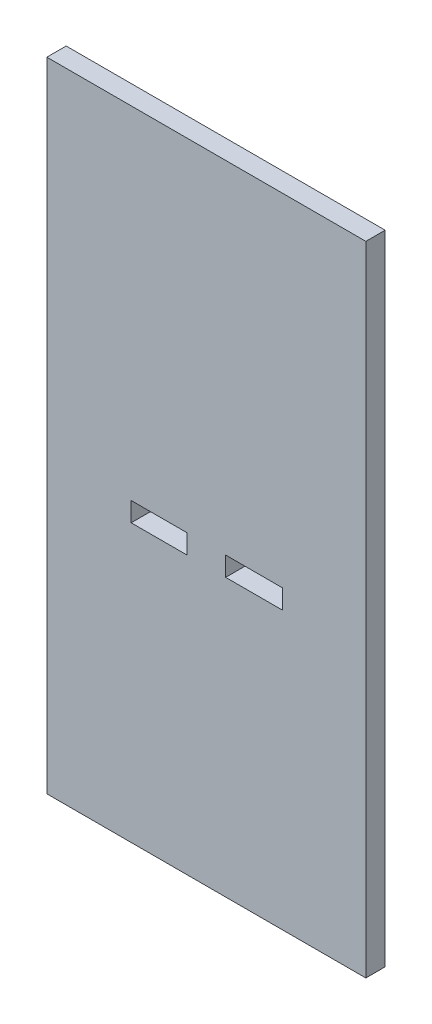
ISO-10303-21;
HEADER;
FILE_DESCRIPTION(('STEP AP214'),'2;1');
FILE_NAME('part.step','',(''),(''),'','','');
FILE_SCHEMA(('AUTOMOTIVE_DESIGN { 1 0 10303 214 1 1 1 1 }'));
ENDSEC;
DATA;
#1=APPLICATION_CONTEXT('core data for automotive mechanical design processes');
#2=APPLICATION_PROTOCOL_DEFINITION('international standard','automotive_design',2000,#1);
#3=PRODUCT_CONTEXT('',#1,'mechanical');
#4=PRODUCT('Part','Part','',(#3));
#5=PRODUCT_RELATED_PRODUCT_CATEGORY('part','',(#4));
#6=PRODUCT_DEFINITION_FORMATION('','',#4);
#7=PRODUCT_DEFINITION_CONTEXT('part definition',#1,'design');
#8=PRODUCT_DEFINITION('design','',#6,#7);
#9=PRODUCT_DEFINITION_SHAPE('','',#8);
#10=(LENGTH_UNIT() NAMED_UNIT(*) SI_UNIT(.MILLI.,.METRE.));
#11=(NAMED_UNIT(*) PLANE_ANGLE_UNIT() SI_UNIT($,.RADIAN.));
#12=(NAMED_UNIT(*) SI_UNIT($,.STERADIAN.) SOLID_ANGLE_UNIT());
#13=UNCERTAINTY_MEASURE_WITH_UNIT(LENGTH_MEASURE(1.E-05),#10,'distance_accuracy_value','');
#14=(GEOMETRIC_REPRESENTATION_CONTEXT(3) GLOBAL_UNCERTAINTY_ASSIGNED_CONTEXT((#13)) GLOBAL_UNIT_ASSIGNED_CONTEXT((#10,
#11,#12)) REPRESENTATION_CONTEXT('',''));
#15=CARTESIAN_POINT('',(0.,0.,0.));
#16=DIRECTION('',(0.,0.,1.));
#17=DIRECTION('',(1.,0.,0.));
#18=AXIS2_PLACEMENT_3D('',#15,#16,#17);
#19=CARTESIAN_POINT('',(488.098625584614,0.,5.3848));
#20=DIRECTION('',(1.,0.,0.));
#21=DIRECTION('',(0.,0.,-1.));
#22=AXIS2_PLACEMENT_3D('',#19,#20,#21);
#23=PLANE('',#22);
#24=DIRECTION('',(0.,-1.,0.));
#25=VECTOR('',#24,1.);
#26=CARTESIAN_POINT('',(488.098625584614,0.,0.));
#27=LINE('',#26,#25);
#28=CARTESIAN_POINT('',(488.098625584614,502.023328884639,0.));
#29=VERTEX_POINT('',#28);
#30=CARTESIAN_POINT('',(488.098625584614,496.638528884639,0.));
#31=VERTEX_POINT('',#30);
#32=EDGE_CURVE('E175',#29,#31,#27,.T.);
#33=ORIENTED_EDGE('',*,*,#32,.T.);
#34=DIRECTION('',(0.,0.,-1.));
#35=VECTOR('',#34,1.);
#36=CARTESIAN_POINT('',(488.098625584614,496.638528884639,5.3848));
#37=LINE('',#36,#35);
#38=CARTESIAN_POINT('',(488.098625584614,496.638528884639,5.3848));
#39=VERTEX_POINT('',#38);
#40=EDGE_CURVE('E11',#39,#31,#37,.T.);
#41=ORIENTED_EDGE('',*,*,#40,.F.);
#42=DIRECTION('',(0.,-1.,0.));
#43=VECTOR('',#42,1.);
#44=CARTESIAN_POINT('',(488.098625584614,0.,5.3848));
#45=LINE('',#44,#43);
#46=CARTESIAN_POINT('',(488.098625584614,502.023328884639,5.3848));
#47=VERTEX_POINT('',#46);
#48=EDGE_CURVE('E137',#47,#39,#45,.T.);
#49=ORIENTED_EDGE('',*,*,#48,.F.);
#50=DIRECTION('',(0.,0.,-1.));
#51=VECTOR('',#50,1.);
#52=CARTESIAN_POINT('',(488.098625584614,502.023328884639,5.3848));
#53=LINE('',#52,#51);
#54=EDGE_CURVE('E182',#47,#29,#53,.T.);
#55=ORIENTED_EDGE('',*,*,#54,.T.);
#56=EDGE_LOOP('',(#33,#41,#49,#55));
#57=FACE_BOUND('',#56,.T.);
#58=ADVANCED_FACE('F32',(#57),#23,.F.);
#59=CARTESIAN_POINT('',(0.,496.638528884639,5.3848));
#60=DIRECTION('',(0.,-1.,0.));
#61=DIRECTION('',(0.,0.,-1.));
#62=AXIS2_PLACEMENT_3D('',#59,#60,#61);
#63=PLANE('',#62);
#64=DIRECTION('',(-1.,0.,0.));
#65=VECTOR('',#64,1.);
#66=CARTESIAN_POINT('',(0.,496.638528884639,0.));
#67=LINE('',#66,#65);
#68=CARTESIAN_POINT('',(472.528425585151,496.638528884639,0.));
#69=VERTEX_POINT('',#68);
#70=EDGE_CURVE('E142',#31,#69,#67,.T.);
#71=ORIENTED_EDGE('',*,*,#70,.T.);
#72=DIRECTION('',(0.,0.,-1.));
#73=VECTOR('',#72,1.);
#74=CARTESIAN_POINT('',(472.528425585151,496.638528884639,5.3848));
#75=LINE('',#74,#73);
#76=CARTESIAN_POINT('',(472.528425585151,496.638528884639,5.3848));
#77=VERTEX_POINT('',#76);
#78=EDGE_CURVE('E42',#77,#69,#75,.T.);
#79=ORIENTED_EDGE('',*,*,#78,.F.);
#80=DIRECTION('',(-1.,0.,0.));
#81=VECTOR('',#80,1.);
#82=CARTESIAN_POINT('',(0.,496.638528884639,5.3848));
#83=LINE('',#82,#81);
#84=EDGE_CURVE('E131',#39,#77,#83,.T.);
#85=ORIENTED_EDGE('',*,*,#84,.F.);
#86=ORIENTED_EDGE('',*,*,#40,.T.);
#87=EDGE_LOOP('',(#71,#79,#85,#86));
#88=FACE_BOUND('',#87,.T.);
#89=ADVANCED_FACE('F141',(#88),#63,.F.);
#90=CARTESIAN_POINT('',(472.528425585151,0.,5.3848));
#91=DIRECTION('',(-1.,0.,0.));
#92=DIRECTION('',(0.,0.,1.));
#93=AXIS2_PLACEMENT_3D('',#90,#91,#92);
#94=PLANE('',#93);
#95=DIRECTION('',(0.,1.,0.));
#96=VECTOR('',#95,1.);
#97=CARTESIAN_POINT('',(472.528425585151,0.,0.));
#98=LINE('',#97,#96);
#99=CARTESIAN_POINT('',(472.528425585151,502.023328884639,0.));
#100=VERTEX_POINT('',#99);
#101=EDGE_CURVE('E92',#69,#100,#98,.T.);
#102=ORIENTED_EDGE('',*,*,#101,.T.);
#103=DIRECTION('',(0.,0.,-1.));
#104=VECTOR('',#103,1.);
#105=CARTESIAN_POINT('',(472.528425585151,502.023328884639,5.3848));
#106=LINE('',#105,#104);
#107=CARTESIAN_POINT('',(472.528425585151,502.023328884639,5.3848));
#108=VERTEX_POINT('',#107);
#109=EDGE_CURVE('E143',#108,#100,#106,.T.);
#110=ORIENTED_EDGE('',*,*,#109,.F.);
#111=DIRECTION('',(0.,1.,0.));
#112=VECTOR('',#111,1.);
#113=CARTESIAN_POINT('',(472.528425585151,0.,5.3848));
#114=LINE('',#113,#112);
#115=EDGE_CURVE('E135',#77,#108,#114,.T.);
#116=ORIENTED_EDGE('',*,*,#115,.F.);
#117=ORIENTED_EDGE('',*,*,#78,.T.);
#118=EDGE_LOOP('',(#102,#110,#116,#117));
#119=FACE_BOUND('',#118,.T.);
#120=ADVANCED_FACE('F145',(#119),#94,.F.);
#121=CARTESIAN_POINT('',(537.933425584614,0.,5.3848));
#122=DIRECTION('',(1.,0.,0.));
#123=DIRECTION('',(0.,0.,-1.));
#124=AXIS2_PLACEMENT_3D('',#121,#122,#123);
#125=PLANE('',#124);
#126=DIRECTION('',(0.,-1.,0.));
#127=VECTOR('',#126,1.);
#128=CARTESIAN_POINT('',(537.933425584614,0.,0.));
#129=LINE('',#128,#127);
#130=CARTESIAN_POINT('',(537.933425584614,597.273328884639,0.));
#131=VERTEX_POINT('',#130);
#132=CARTESIAN_POINT('',(537.933425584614,419.473328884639,0.));
#133=VERTEX_POINT('',#132);
#134=EDGE_CURVE('E163',#131,#133,#129,.T.);
#135=ORIENTED_EDGE('',*,*,#134,.F.);
#136=DIRECTION('',(0.,0.,-1.));
#137=VECTOR('',#136,1.);
#138=CARTESIAN_POINT('',(537.933425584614,597.273328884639,5.3848));
#139=LINE('',#138,#137);
#140=CARTESIAN_POINT('',(537.933425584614,597.273328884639,5.3848));
#141=VERTEX_POINT('',#140);
#142=EDGE_CURVE('E184',#141,#131,#139,.T.);
#143=ORIENTED_EDGE('',*,*,#142,.F.);
#144=DIRECTION('',(0.,-1.,0.));
#145=VECTOR('',#144,1.);
#146=CARTESIAN_POINT('',(537.933425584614,0.,5.3848));
#147=LINE('',#146,#145);
#148=CARTESIAN_POINT('',(537.933425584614,419.473328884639,5.3848));
#149=VERTEX_POINT('',#148);
#150=EDGE_CURVE('E221',#141,#149,#147,.T.);
#151=ORIENTED_EDGE('',*,*,#150,.T.);
#152=DIRECTION('',(0.,0.,-1.));
#153=VECTOR('',#152,1.);
#154=CARTESIAN_POINT('',(537.933425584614,419.473328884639,5.3848));
#155=LINE('',#154,#153);
#156=EDGE_CURVE('E186',#149,#133,#155,.T.);
#157=ORIENTED_EDGE('',*,*,#156,.T.);
#158=EDGE_LOOP('',(#135,#143,#151,#157));
#159=FACE_BOUND('',#158,.T.);
#160=ADVANCED_FACE('F243',(#159),#125,.T.);
#161=CARTESIAN_POINT('',(0.,597.273328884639,5.3848));
#162=DIRECTION('',(0.,1.,0.));
#163=DIRECTION('',(0.,0.,1.));
#164=AXIS2_PLACEMENT_3D('',#161,#162,#163);
#165=PLANE('',#164);
#166=DIRECTION('',(1.,0.,0.));
#167=VECTOR('',#166,1.);
#168=CARTESIAN_POINT('',(0.,597.273328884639,0.));
#169=LINE('',#168,#167);
#170=CARTESIAN_POINT('',(449.033425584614,597.273328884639,0.));
#171=VERTEX_POINT('',#170);
#172=EDGE_CURVE('E166',#171,#131,#169,.T.);
#173=ORIENTED_EDGE('',*,*,#172,.F.);
#174=DIRECTION('',(0.,0.,-1.));
#175=VECTOR('',#174,1.);
#176=CARTESIAN_POINT('',(449.033425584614,597.273328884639,5.3848));
#177=LINE('',#176,#175);
#178=CARTESIAN_POINT('',(449.033425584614,597.273328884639,5.3848));
#179=VERTEX_POINT('',#178);
#180=EDGE_CURVE('E191',#179,#171,#177,.T.);
#181=ORIENTED_EDGE('',*,*,#180,.F.);
#182=DIRECTION('',(1.,0.,0.));
#183=VECTOR('',#182,1.);
#184=CARTESIAN_POINT('',(0.,597.273328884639,5.3848));
#185=LINE('',#184,#183);
#186=EDGE_CURVE('E224',#179,#141,#185,.T.);
#187=ORIENTED_EDGE('',*,*,#186,.T.);
#188=ORIENTED_EDGE('',*,*,#142,.T.);
#189=EDGE_LOOP('',(#173,#181,#187,#188));
#190=FACE_BOUND('',#189,.T.);
#191=ADVANCED_FACE('F246',(#190),#165,.T.);
#192=CARTESIAN_POINT('',(449.033425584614,-1.38777878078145E-13,5.3848));
#193=DIRECTION('',(1.,0.,0.));
#194=DIRECTION('',(0.,1.,0.));
#195=AXIS2_PLACEMENT_3D('',#192,#193,#194);
#196=PLANE('',#195);
#197=DIRECTION('',(0.,-1.,0.));
#198=VECTOR('',#197,1.);
#199=CARTESIAN_POINT('',(449.033425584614,-1.38777878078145E-13,0.));
#200=LINE('',#199,#198);
#201=CARTESIAN_POINT('',(449.033425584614,419.473328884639,0.));
#202=VERTEX_POINT('',#201);
#203=EDGE_CURVE('E169',#171,#202,#200,.T.);
#204=ORIENTED_EDGE('',*,*,#203,.T.);
#205=DIRECTION('',(0.,0.,-1.));
#206=VECTOR('',#205,1.);
#207=CARTESIAN_POINT('',(449.033425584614,419.473328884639,5.3848));
#208=LINE('',#207,#206);
#209=CARTESIAN_POINT('',(449.033425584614,419.473328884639,5.3848));
#210=VERTEX_POINT('',#209);
#211=EDGE_CURVE('E188',#210,#202,#208,.T.);
#212=ORIENTED_EDGE('',*,*,#211,.F.);
#213=DIRECTION('',(0.,-1.,0.));
#214=VECTOR('',#213,1.);
#215=CARTESIAN_POINT('',(449.033425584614,-1.38777878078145E-13,5.3848));
#216=LINE('',#215,#214);
#217=EDGE_CURVE('E230',#179,#210,#216,.T.);
#218=ORIENTED_EDGE('',*,*,#217,.F.);
#219=ORIENTED_EDGE('',*,*,#180,.T.);
#220=EDGE_LOOP('',(#204,#212,#218,#219));
#221=FACE_BOUND('',#220,.T.);
#222=ADVANCED_FACE('F249',(#221),#196,.F.);
#223=CARTESIAN_POINT('',(0.,496.638528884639,5.3848));
#224=DIRECTION('',(0.,1.,0.));
#225=DIRECTION('',(0.,0.,1.));
#226=AXIS2_PLACEMENT_3D('',#223,#224,#225);
#227=PLANE('',#226);
#228=DIRECTION('',(1.,0.,0.));
#229=VECTOR('',#228,1.);
#230=CARTESIAN_POINT('',(0.,496.638528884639,0.));
#231=LINE('',#230,#229);
#232=CARTESIAN_POINT('',(498.868225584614,496.638528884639,0.));
#233=VERTEX_POINT('',#232);
#234=CARTESIAN_POINT('',(514.692425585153,496.638528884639,0.));
#235=VERTEX_POINT('',#234);
#236=EDGE_CURVE('E151',#233,#235,#231,.T.);
#237=ORIENTED_EDGE('',*,*,#236,.F.);
#238=DIRECTION('',(0.,0.,-1.));
#239=VECTOR('',#238,1.);
#240=CARTESIAN_POINT('',(498.868225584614,496.638528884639,5.3848));
#241=LINE('',#240,#239);
#242=CARTESIAN_POINT('',(498.868225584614,496.638528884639,5.3848));
#243=VERTEX_POINT('',#242);
#244=EDGE_CURVE('E36',#243,#233,#241,.T.);
#245=ORIENTED_EDGE('',*,*,#244,.F.);
#246=DIRECTION('',(1.,0.,0.));
#247=VECTOR('',#246,1.);
#248=CARTESIAN_POINT('',(0.,496.638528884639,5.3848));
#249=LINE('',#248,#247);
#250=CARTESIAN_POINT('',(514.692425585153,496.638528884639,5.3848));
#251=VERTEX_POINT('',#250);
#252=EDGE_CURVE('E181',#243,#251,#249,.T.);
#253=ORIENTED_EDGE('',*,*,#252,.T.);
#254=DIRECTION('',(0.,0.,-1.));
#255=VECTOR('',#254,1.);
#256=CARTESIAN_POINT('',(514.692425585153,496.638528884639,5.3848));
#257=LINE('',#256,#255);
#258=EDGE_CURVE('E147',#251,#235,#257,.T.);
#259=ORIENTED_EDGE('',*,*,#258,.T.);
#260=EDGE_LOOP('',(#237,#245,#253,#259));
#261=FACE_BOUND('',#260,.T.);
#262=ADVANCED_FACE('F34',(#261),#227,.T.);
#263=CARTESIAN_POINT('',(498.868225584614,0.,5.3848));
#264=DIRECTION('',(1.,0.,0.));
#265=DIRECTION('',(0.,0.,-1.));
#266=AXIS2_PLACEMENT_3D('',#263,#264,#265);
#267=PLANE('',#266);
#268=DIRECTION('',(0.,-1.,0.));
#269=VECTOR('',#268,1.);
#270=CARTESIAN_POINT('',(498.868225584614,0.,0.));
#271=LINE('',#270,#269);
#272=CARTESIAN_POINT('',(498.868225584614,502.023328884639,0.));
#273=VERTEX_POINT('',#272);
#274=EDGE_CURVE('E154',#273,#233,#271,.T.);
#275=ORIENTED_EDGE('',*,*,#274,.F.);
#276=DIRECTION('',(0.,0.,-1.));
#277=VECTOR('',#276,1.);
#278=CARTESIAN_POINT('',(498.868225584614,502.023328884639,5.3848));
#279=LINE('',#278,#277);
#280=CARTESIAN_POINT('',(498.868225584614,502.023328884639,5.3848));
#281=VERTEX_POINT('',#280);
#282=EDGE_CURVE('E196',#281,#273,#279,.T.);
#283=ORIENTED_EDGE('',*,*,#282,.F.);
#284=DIRECTION('',(0.,-1.,0.));
#285=VECTOR('',#284,1.);
#286=CARTESIAN_POINT('',(498.868225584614,0.,5.3848));
#287=LINE('',#286,#285);
#288=EDGE_CURVE('E205',#281,#243,#287,.T.);
#289=ORIENTED_EDGE('',*,*,#288,.T.);
#290=ORIENTED_EDGE('',*,*,#244,.T.);
#291=EDGE_LOOP('',(#275,#283,#289,#290));
#292=FACE_BOUND('',#291,.T.);
#293=ADVANCED_FACE('F203',(#292),#267,.T.);
#294=CARTESIAN_POINT('',(0.,502.023328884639,5.3848));
#295=DIRECTION('',(0.,-1.,0.));
#296=DIRECTION('',(0.,0.,-1.));
#297=AXIS2_PLACEMENT_3D('',#294,#295,#296);
#298=PLANE('',#297);
#299=DIRECTION('',(-1.,0.,0.));
#300=VECTOR('',#299,1.);
#301=CARTESIAN_POINT('',(0.,502.023328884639,0.));
#302=LINE('',#301,#300);
#303=CARTESIAN_POINT('',(514.692425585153,502.023328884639,0.));
#304=VERTEX_POINT('',#303);
#305=EDGE_CURVE('E157',#304,#273,#302,.T.);
#306=ORIENTED_EDGE('',*,*,#305,.F.);
#307=DIRECTION('',(0.,0.,-1.));
#308=VECTOR('',#307,1.);
#309=CARTESIAN_POINT('',(514.692425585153,502.023328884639,5.3848));
#310=LINE('',#309,#308);
#311=CARTESIAN_POINT('',(514.692425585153,502.023328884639,5.3848));
#312=VERTEX_POINT('',#311);
#313=EDGE_CURVE('E195',#312,#304,#310,.T.);
#314=ORIENTED_EDGE('',*,*,#313,.F.);
#315=DIRECTION('',(-1.,0.,0.));
#316=VECTOR('',#315,1.);
#317=CARTESIAN_POINT('',(0.,502.023328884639,5.3848));
#318=LINE('',#317,#316);
#319=EDGE_CURVE('E212',#312,#281,#318,.T.);
#320=ORIENTED_EDGE('',*,*,#319,.T.);
#321=ORIENTED_EDGE('',*,*,#282,.T.);
#322=EDGE_LOOP('',(#306,#314,#320,#321));
#323=FACE_BOUND('',#322,.T.);
#324=ADVANCED_FACE('F210',(#323),#298,.T.);
#325=CARTESIAN_POINT('',(0.,419.473328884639,5.3848));
#326=DIRECTION('',(0.,1.,0.));
#327=DIRECTION('',(0.,0.,1.));
#328=AXIS2_PLACEMENT_3D('',#325,#326,#327);
#329=PLANE('',#328);
#330=DIRECTION('',(1.,0.,0.));
#331=VECTOR('',#330,1.);
#332=CARTESIAN_POINT('',(0.,419.473328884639,0.));
#333=LINE('',#332,#331);
#334=EDGE_CURVE('E172',#202,#133,#333,.T.);
#335=ORIENTED_EDGE('',*,*,#334,.T.);
#336=ORIENTED_EDGE('',*,*,#156,.F.);
#337=DIRECTION('',(1.,0.,0.));
#338=VECTOR('',#337,1.);
#339=CARTESIAN_POINT('',(0.,419.473328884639,5.3848));
#340=LINE('',#339,#338);
#341=EDGE_CURVE('E233',#210,#149,#340,.T.);
#342=ORIENTED_EDGE('',*,*,#341,.F.);
#343=ORIENTED_EDGE('',*,*,#211,.T.);
#344=EDGE_LOOP('',(#335,#336,#342,#343));
#345=FACE_BOUND('',#344,.T.);
#346=ADVANCED_FACE('F240',(#345),#329,.F.);
#347=CARTESIAN_POINT('',(514.692425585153,0.,5.3848));
#348=DIRECTION('',(-1.,0.,0.));
#349=DIRECTION('',(0.,0.,1.));
#350=AXIS2_PLACEMENT_3D('',#347,#348,#349);
#351=PLANE('',#350);
#352=DIRECTION('',(0.,1.,0.));
#353=VECTOR('',#352,1.);
#354=CARTESIAN_POINT('',(514.692425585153,0.,0.));
#355=LINE('',#354,#353);
#356=EDGE_CURVE('E160',#235,#304,#355,.T.);
#357=ORIENTED_EDGE('',*,*,#356,.F.);
#358=ORIENTED_EDGE('',*,*,#258,.F.);
#359=DIRECTION('',(0.,1.,0.));
#360=VECTOR('',#359,1.);
#361=CARTESIAN_POINT('',(514.692425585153,0.,5.3848));
#362=LINE('',#361,#360);
#363=EDGE_CURVE('E218',#251,#312,#362,.T.);
#364=ORIENTED_EDGE('',*,*,#363,.T.);
#365=ORIENTED_EDGE('',*,*,#313,.T.);
#366=EDGE_LOOP('',(#357,#358,#364,#365));
#367=FACE_BOUND('',#366,.T.);
#368=ADVANCED_FACE('F220',(#367),#351,.T.);
#369=CARTESIAN_POINT('',(0.,502.023328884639,5.3848));
#370=DIRECTION('',(0.,1.,0.));
#371=DIRECTION('',(0.,0.,1.));
#372=AXIS2_PLACEMENT_3D('',#369,#370,#371);
#373=PLANE('',#372);
#374=DIRECTION('',(1.,0.,0.));
#375=VECTOR('',#374,1.);
#376=CARTESIAN_POINT('',(0.,502.023328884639,0.));
#377=LINE('',#376,#375);
#378=EDGE_CURVE('E98',#100,#29,#377,.T.);
#379=ORIENTED_EDGE('',*,*,#378,.T.);
#380=ORIENTED_EDGE('',*,*,#54,.F.);
#381=DIRECTION('',(1.,0.,0.));
#382=VECTOR('',#381,1.);
#383=CARTESIAN_POINT('',(0.,502.023328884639,5.3848));
#384=LINE('',#383,#382);
#385=EDGE_CURVE('E51',#108,#47,#384,.T.);
#386=ORIENTED_EDGE('',*,*,#385,.F.);
#387=ORIENTED_EDGE('',*,*,#109,.T.);
#388=EDGE_LOOP('',(#379,#380,#386,#387));
#389=FACE_BOUND('',#388,.T.);
#390=ADVANCED_FACE('F255',(#389),#373,.F.);
#391=CARTESIAN_POINT('',(0.,0.,5.3848));
#392=DIRECTION('',(0.,0.,1.));
#393=DIRECTION('',(1.,0.,0.));
#394=AXIS2_PLACEMENT_3D('',#391,#392,#393);
#395=PLANE('',#394);
#396=ORIENTED_EDGE('',*,*,#252,.F.);
#397=ORIENTED_EDGE('',*,*,#288,.F.);
#398=ORIENTED_EDGE('',*,*,#319,.F.);
#399=ORIENTED_EDGE('',*,*,#363,.F.);
#400=EDGE_LOOP('',(#396,#397,#398,#399));
#401=FACE_BOUND('',#400,.T.);
#402=ORIENTED_EDGE('',*,*,#150,.F.);
#403=ORIENTED_EDGE('',*,*,#186,.F.);
#404=ORIENTED_EDGE('',*,*,#217,.T.);
#405=ORIENTED_EDGE('',*,*,#341,.T.);
#406=EDGE_LOOP('',(#402,#403,#404,#405));
#407=FACE_BOUND('',#406,.T.);
#408=ORIENTED_EDGE('',*,*,#48,.T.);
#409=ORIENTED_EDGE('',*,*,#84,.T.);
#410=ORIENTED_EDGE('',*,*,#115,.T.);
#411=ORIENTED_EDGE('',*,*,#385,.T.);
#412=EDGE_LOOP('',(#408,#409,#410,#411));
#413=FACE_BOUND('',#412,.T.);
#414=ADVANCED_FACE('F133',(#401,#407,#413),#395,.T.);
#415=CARTESIAN_POINT('',(0.,0.,0.));
#416=DIRECTION('',(0.,0.,1.));
#417=DIRECTION('',(1.,0.,0.));
#418=AXIS2_PLACEMENT_3D('',#415,#416,#417);
#419=PLANE('',#418);
#420=ORIENTED_EDGE('',*,*,#236,.T.);
#421=ORIENTED_EDGE('',*,*,#356,.T.);
#422=ORIENTED_EDGE('',*,*,#305,.T.);
#423=ORIENTED_EDGE('',*,*,#274,.T.);
#424=EDGE_LOOP('',(#420,#421,#422,#423));
#425=FACE_BOUND('',#424,.T.);
#426=ORIENTED_EDGE('',*,*,#134,.T.);
#427=ORIENTED_EDGE('',*,*,#334,.F.);
#428=ORIENTED_EDGE('',*,*,#203,.F.);
#429=ORIENTED_EDGE('',*,*,#172,.T.);
#430=EDGE_LOOP('',(#426,#427,#428,#429));
#431=FACE_BOUND('',#430,.T.);
#432=ORIENTED_EDGE('',*,*,#32,.F.);
#433=ORIENTED_EDGE('',*,*,#378,.F.);
#434=ORIENTED_EDGE('',*,*,#101,.F.);
#435=ORIENTED_EDGE('',*,*,#70,.F.);
#436=EDGE_LOOP('',(#432,#433,#434,#435));
#437=FACE_BOUND('',#436,.T.);
#438=ADVANCED_FACE('F208',(#425,#431,#437),#419,.F.);
#439=CLOSED_SHELL('',(#58,#89,#120,#160,#191,#222,#262,#293,#324,#346,#368,#390,#414,#438));
#440=MANIFOLD_SOLID_BREP('B2',#439);
#441=ADVANCED_BREP_SHAPE_REPRESENTATION('',(#18,#440),#14);
#442=SHAPE_DEFINITION_REPRESENTATION(#9,#441);
ENDSEC;
END-ISO-10303-21;
